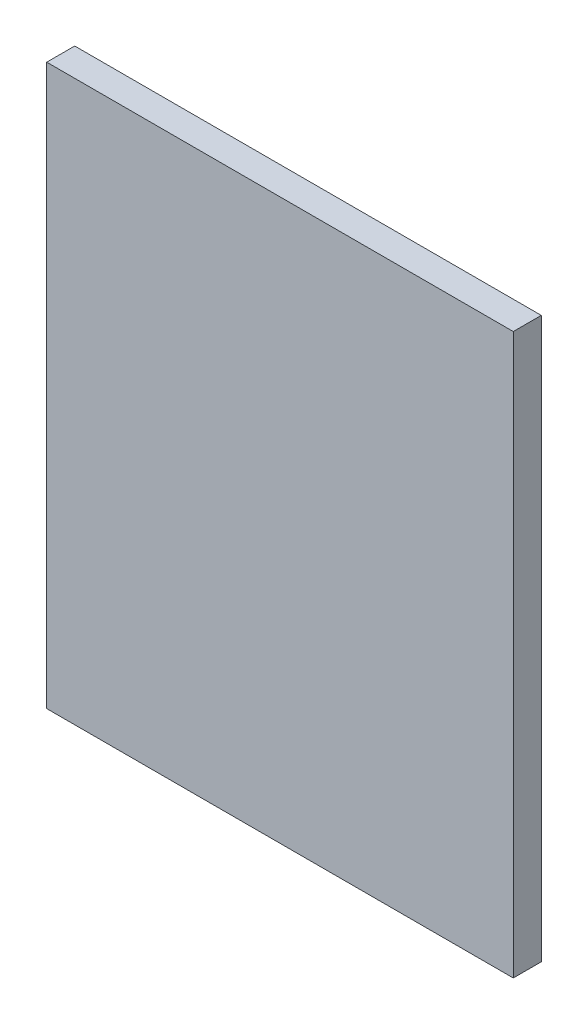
ISO-10303-21;
HEADER;
FILE_DESCRIPTION(('STEP AP214'),'2;1');
FILE_NAME('part.step','',(''),(''),'','','');
FILE_SCHEMA(('AUTOMOTIVE_DESIGN { 1 0 10303 214 1 1 1 1 }'));
ENDSEC;
DATA;
#1=APPLICATION_CONTEXT('core data for automotive mechanical design processes');
#2=APPLICATION_PROTOCOL_DEFINITION('international standard','automotive_design',2000,#1);
#3=PRODUCT_CONTEXT('',#1,'mechanical');
#4=PRODUCT('Part','Part','',(#3));
#5=PRODUCT_RELATED_PRODUCT_CATEGORY('part','',(#4));
#6=PRODUCT_DEFINITION_FORMATION('','',#4);
#7=PRODUCT_DEFINITION_CONTEXT('part definition',#1,'design');
#8=PRODUCT_DEFINITION('design','',#6,#7);
#9=PRODUCT_DEFINITION_SHAPE('','',#8);
#10=(LENGTH_UNIT() NAMED_UNIT(*) SI_UNIT(.MILLI.,.METRE.));
#11=(NAMED_UNIT(*) PLANE_ANGLE_UNIT() SI_UNIT($,.RADIAN.));
#12=(NAMED_UNIT(*) SI_UNIT($,.STERADIAN.) SOLID_ANGLE_UNIT());
#13=UNCERTAINTY_MEASURE_WITH_UNIT(LENGTH_MEASURE(1.E-05),#10,'distance_accuracy_value','');
#14=(GEOMETRIC_REPRESENTATION_CONTEXT(3) GLOBAL_UNCERTAINTY_ASSIGNED_CONTEXT((#13)) GLOBAL_UNIT_ASSIGNED_CONTEXT((#10,
#11,#12)) REPRESENTATION_CONTEXT('',''));
#15=CARTESIAN_POINT('',(0.,0.,0.));
#16=DIRECTION('',(0.,0.,1.));
#17=DIRECTION('',(1.,0.,0.));
#18=AXIS2_PLACEMENT_3D('',#15,#16,#17);
#19=CARTESIAN_POINT('',(0.,0.,12.));
#20=DIRECTION('',(0.,0.,1.));
#21=DIRECTION('',(1.,0.,0.));
#22=AXIS2_PLACEMENT_3D('',#19,#20,#21);
#23=PLANE('',#22);
#24=DIRECTION('',(1.,0.,0.));
#25=VECTOR('',#24,1.);
#26=CARTESIAN_POINT('',(-100.,-120.,12.));
#27=LINE('',#26,#25);
#28=CARTESIAN_POINT('',(-100.,-120.,12.));
#29=VERTEX_POINT('',#28);
#30=CARTESIAN_POINT('',(100.,-120.,12.));
#31=VERTEX_POINT('',#30);
#32=EDGE_CURVE('E97',#29,#31,#27,.T.);
#33=ORIENTED_EDGE('',*,*,#32,.T.);
#34=DIRECTION('',(0.,1.,0.));
#35=VECTOR('',#34,1.);
#36=CARTESIAN_POINT('',(100.,-120.,12.));
#37=LINE('',#36,#35);
#38=CARTESIAN_POINT('',(100.,120.,12.));
#39=VERTEX_POINT('',#38);
#40=EDGE_CURVE('E76',#31,#39,#37,.T.);
#41=ORIENTED_EDGE('',*,*,#40,.T.);
#42=DIRECTION('',(-1.,0.,0.));
#43=VECTOR('',#42,1.);
#44=CARTESIAN_POINT('',(100.,120.,12.));
#45=LINE('',#44,#43);
#46=CARTESIAN_POINT('',(-100.,120.,12.));
#47=VERTEX_POINT('',#46);
#48=EDGE_CURVE('E81',#39,#47,#45,.T.);
#49=ORIENTED_EDGE('',*,*,#48,.T.);
#50=DIRECTION('',(0.,-1.,0.));
#51=VECTOR('',#50,1.);
#52=CARTESIAN_POINT('',(-100.,120.,12.));
#53=LINE('',#52,#51);
#54=EDGE_CURVE('E10',#47,#29,#53,.T.);
#55=ORIENTED_EDGE('',*,*,#54,.T.);
#56=EDGE_LOOP('',(#33,#41,#49,#55));
#57=FACE_BOUND('',#56,.T.);
#58=ADVANCED_FACE('F16',(#57),#23,.T.);
#59=CARTESIAN_POINT('',(0.,0.,0.));
#60=DIRECTION('',(0.,0.,1.));
#61=DIRECTION('',(1.,0.,0.));
#62=AXIS2_PLACEMENT_3D('',#59,#60,#61);
#63=PLANE('',#62);
#64=DIRECTION('',(0.,-1.,0.));
#65=VECTOR('',#64,1.);
#66=CARTESIAN_POINT('',(-100.,120.,0.));
#67=LINE('',#66,#65);
#68=CARTESIAN_POINT('',(-100.,120.,0.));
#69=VERTEX_POINT('',#68);
#70=CARTESIAN_POINT('',(-100.,-120.,0.));
#71=VERTEX_POINT('',#70);
#72=EDGE_CURVE('E24',#69,#71,#67,.T.);
#73=ORIENTED_EDGE('',*,*,#72,.F.);
#74=DIRECTION('',(-1.,0.,0.));
#75=VECTOR('',#74,1.);
#76=CARTESIAN_POINT('',(100.,120.,0.));
#77=LINE('',#76,#75);
#78=CARTESIAN_POINT('',(100.,120.,0.));
#79=VERTEX_POINT('',#78);
#80=EDGE_CURVE('E66',#79,#69,#77,.T.);
#81=ORIENTED_EDGE('',*,*,#80,.F.);
#82=DIRECTION('',(0.,1.,0.));
#83=VECTOR('',#82,1.);
#84=CARTESIAN_POINT('',(100.,-120.,0.));
#85=LINE('',#84,#83);
#86=CARTESIAN_POINT('',(100.,-120.,0.));
#87=VERTEX_POINT('',#86);
#88=EDGE_CURVE('E70',#87,#79,#85,.T.);
#89=ORIENTED_EDGE('',*,*,#88,.F.);
#90=DIRECTION('',(1.,0.,0.));
#91=VECTOR('',#90,1.);
#92=CARTESIAN_POINT('',(-100.,-120.,0.));
#93=LINE('',#92,#91);
#94=EDGE_CURVE('E113',#71,#87,#93,.T.);
#95=ORIENTED_EDGE('',*,*,#94,.F.);
#96=EDGE_LOOP('',(#73,#81,#89,#95));
#97=FACE_BOUND('',#96,.T.);
#98=ADVANCED_FACE('F68',(#97),#63,.F.);
#99=CARTESIAN_POINT('',(-100.,120.,0.));
#100=DIRECTION('',(1.,0.,0.));
#101=DIRECTION('',(0.,1.,0.));
#102=AXIS2_PLACEMENT_3D('',#99,#100,#101);
#103=PLANE('',#102);
#104=ORIENTED_EDGE('',*,*,#72,.T.);
#105=DIRECTION('',(0.,0.,1.));
#106=VECTOR('',#105,1.);
#107=CARTESIAN_POINT('',(-100.,-120.,0.));
#108=LINE('',#107,#106);
#109=EDGE_CURVE('E91',#71,#29,#108,.T.);
#110=ORIENTED_EDGE('',*,*,#109,.T.);
#111=ORIENTED_EDGE('',*,*,#54,.F.);
#112=DIRECTION('',(0.,0.,1.));
#113=VECTOR('',#112,1.);
#114=CARTESIAN_POINT('',(-100.,120.,0.));
#115=LINE('',#114,#113);
#116=EDGE_CURVE('E75',#69,#47,#115,.T.);
#117=ORIENTED_EDGE('',*,*,#116,.F.);
#118=EDGE_LOOP('',(#104,#110,#111,#117));
#119=FACE_BOUND('',#118,.T.);
#120=ADVANCED_FACE('F109',(#119),#103,.F.);
#121=CARTESIAN_POINT('',(100.,120.,0.));
#122=DIRECTION('',(0.,-1.,0.));
#123=DIRECTION('',(0.,0.,-1.));
#124=AXIS2_PLACEMENT_3D('',#121,#122,#123);
#125=PLANE('',#124);
#126=ORIENTED_EDGE('',*,*,#80,.T.);
#127=ORIENTED_EDGE('',*,*,#116,.T.);
#128=ORIENTED_EDGE('',*,*,#48,.F.);
#129=DIRECTION('',(0.,0.,1.));
#130=VECTOR('',#129,1.);
#131=CARTESIAN_POINT('',(100.,120.,0.));
#132=LINE('',#131,#130);
#133=EDGE_CURVE('E79',#79,#39,#132,.T.);
#134=ORIENTED_EDGE('',*,*,#133,.F.);
#135=EDGE_LOOP('',(#126,#127,#128,#134));
#136=FACE_BOUND('',#135,.T.);
#137=ADVANCED_FACE('F80',(#136),#125,.F.);
#138=CARTESIAN_POINT('',(100.,-120.,0.));
#139=DIRECTION('',(-1.,0.,0.));
#140=DIRECTION('',(0.,0.,1.));
#141=AXIS2_PLACEMENT_3D('',#138,#139,#140);
#142=PLANE('',#141);
#143=ORIENTED_EDGE('',*,*,#88,.T.);
#144=ORIENTED_EDGE('',*,*,#133,.T.);
#145=ORIENTED_EDGE('',*,*,#40,.F.);
#146=DIRECTION('',(0.,0.,1.));
#147=VECTOR('',#146,1.);
#148=CARTESIAN_POINT('',(100.,-120.,0.));
#149=LINE('',#148,#147);
#150=EDGE_CURVE('E88',#87,#31,#149,.T.);
#151=ORIENTED_EDGE('',*,*,#150,.F.);
#152=EDGE_LOOP('',(#143,#144,#145,#151));
#153=FACE_BOUND('',#152,.T.);
#154=ADVANCED_FACE('F86',(#153),#142,.F.);
#155=CARTESIAN_POINT('',(-100.,-120.,0.));
#156=DIRECTION('',(0.,1.,0.));
#157=DIRECTION('',(1.,0.,0.));
#158=AXIS2_PLACEMENT_3D('',#155,#156,#157);
#159=PLANE('',#158);
#160=ORIENTED_EDGE('',*,*,#94,.T.);
#161=ORIENTED_EDGE('',*,*,#150,.T.);
#162=ORIENTED_EDGE('',*,*,#32,.F.);
#163=ORIENTED_EDGE('',*,*,#109,.F.);
#164=EDGE_LOOP('',(#160,#161,#162,#163));
#165=FACE_BOUND('',#164,.T.);
#166=ADVANCED_FACE('F112',(#165),#159,.F.);
#167=CLOSED_SHELL('',(#58,#98,#120,#137,#154,#166));
#168=MANIFOLD_SOLID_BREP('B1',#167);
#169=ADVANCED_BREP_SHAPE_REPRESENTATION('',(#18,#168),#14);
#170=SHAPE_DEFINITION_REPRESENTATION(#9,#169);
ENDSEC;
END-ISO-10303-21;
